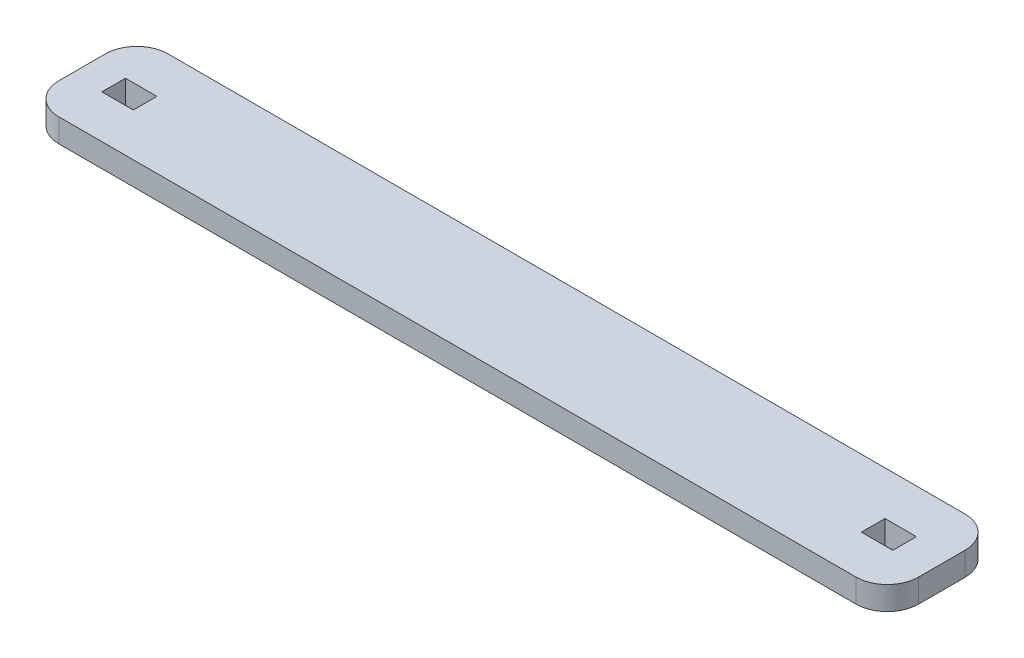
from build123d import *

# Parameters (mm, degrees)
SKETCH1_W       = 20.1
SKETCH1_H       = 15.1
RESPALDOS_DEPTH = 7.5


with BuildPart() as part:
    # Sketch1 → respaldos (new, symmetric)
    with BuildSketch(Plane(origin=(0, 0, 0), x_dir=(1, 0, 0), z_dir=(0, 1, 0))):
        with BuildLine():
            Line((-239.523809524, 48.80952381), (270.476190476, 48.80952381))
            ThreePointArc((270.476190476, 48.80952381), (284.6183261, 42.951659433), (290.476190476, 28.80952381))
            Line((290.476190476, 28.80952381), (290.476190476, -0.99047619))
            ThreePointArc((290.476190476, -0.99047619), (284.6183261, -15.132611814), (270.476190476, -20.99047619))
            Line((270.476190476, -20.99047619), (-239.523809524, -20.99047619))
            ThreePointArc((-239.523809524, -20.99047619), (-253.665945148, -15.132611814), (-259.523809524, -0.99047619))
            Line((-259.523809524, -0.99047619), (-259.523809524, 28.80952381))
            ThreePointArc((-259.523809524, 28.80952381), (-253.665945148, 42.951659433), (-239.523809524, 48.80952381))
        make_face()
        with Locations((-229.560659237, 14.164505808)):
            Rectangle(SKETCH1_W, SKETCH1_H, mode=Mode.SUBTRACT)
        with Locations((257.335233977, 13.164505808)):
            Rectangle(SKETCH1_W, SKETCH1_H, mode=Mode.SUBTRACT)
    extrude(amount=RESPALDOS_DEPTH, both=True)


solid = part.part
